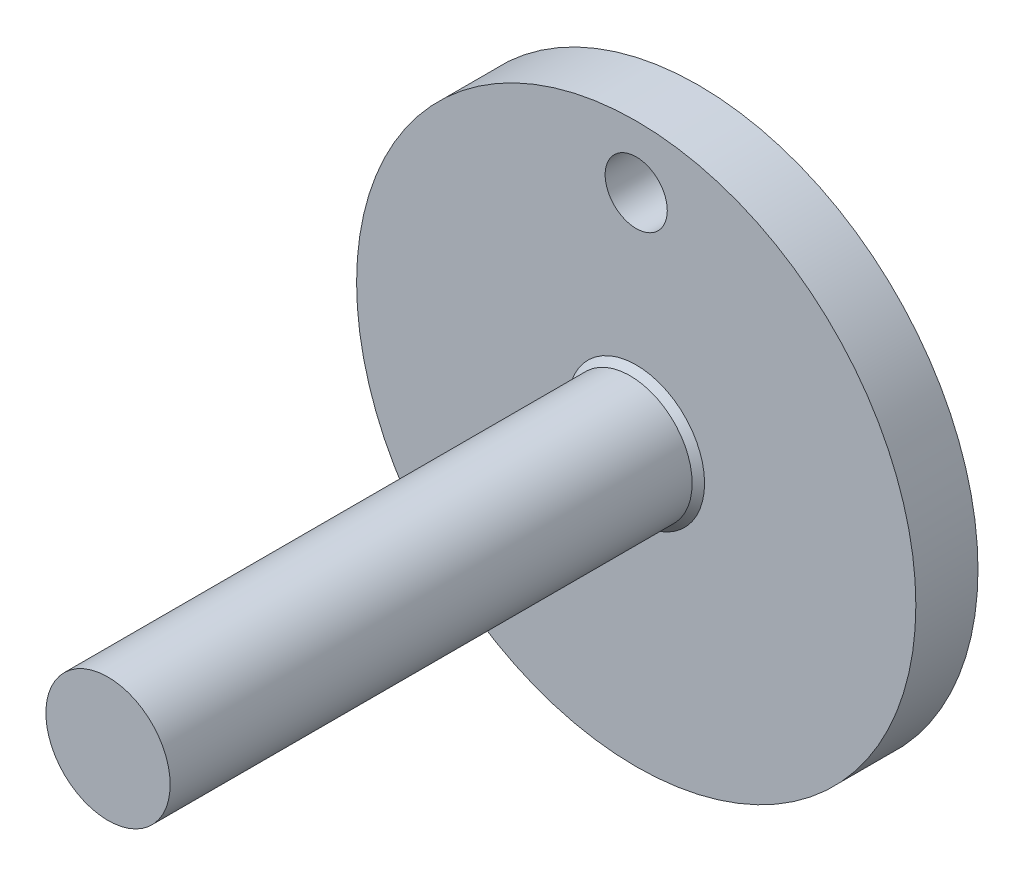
from build123d import *

# Parameters (mm, degrees)
SKETCH1_R           = 45
SKETCH1_R_2         = 5
BOSS_EXTRUDE1_DEPTH = 10
SKETCH2_R           = 10
BOSS_EXTRUDE2_DEPTH = 85
CHAMFER1_SIZE       = 1


with BuildPart() as part:
    # Sketch1 → Boss-Extrude1 (new body)
    with BuildSketch(Plane.XY):
        Circle(SKETCH1_R)
        with Locations((0, 35)):
            Circle(SKETCH1_R_2, mode=Mode.SUBTRACT)
    extrude(amount=BOSS_EXTRUDE1_DEPTH)

    # Sketch2 → Boss-Extrude2 (add)
    with BuildSketch(Plane.XY.offset(10)):
        Circle(SKETCH2_R)
    extrude(amount=BOSS_EXTRUDE2_DEPTH)

    # Chamfer1
    chamfer1_edges = [part.edges().sort_by_distance(p)[0] for p in [
        (-10, 0, 10),
    ]]
    chamfer(chamfer1_edges, length=CHAMFER1_SIZE)


solid = part.part
